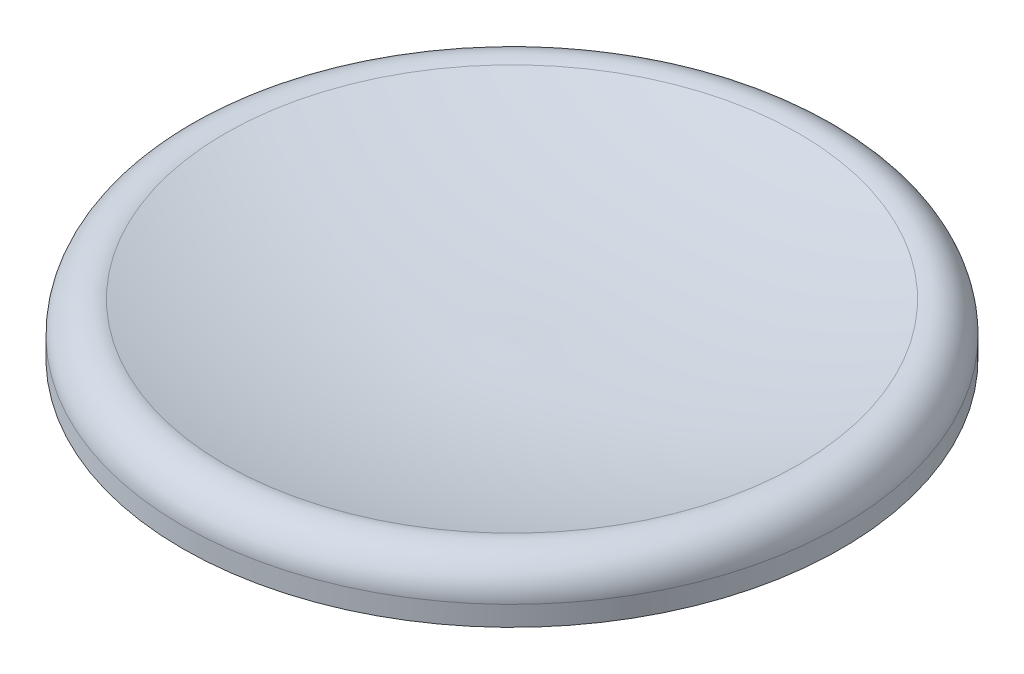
from build123d import *

# Parameters (mm, degrees)
FILLET1_R = 1


with BuildPart() as part:
    # Sketch2 → Revolve1 (revolve)
    with BuildSketch(Plane.XY, mode=Mode.PRIVATE) as revolve1_sk:
        with BuildLine():
            Line((0, 0), (4, 0))
            Line((4, 0), (4, 3))
            Line((4, 3), (10, 3))
            Line((10, 3), (10, 5))
            ThreePointArc((10, 5), (5.078654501, 3.708409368), (0, 3.4))
            Line((0, 3.4), (0, 0))
        make_face()
    revolve(revolve1_sk.sketch.rotate(Axis((0, 0, 0), (0, 1, 0)), 90), axis=Axis((0, 0, 0), (0, 1, 0)))

    # Fillet1
    fillet1_edges = [part.edges().sort_by_distance(p)[0] for p in [
        (0, 5, 10),
    ]]
    fillet(fillet1_edges, radius=FILLET1_R)


solid = part.part
